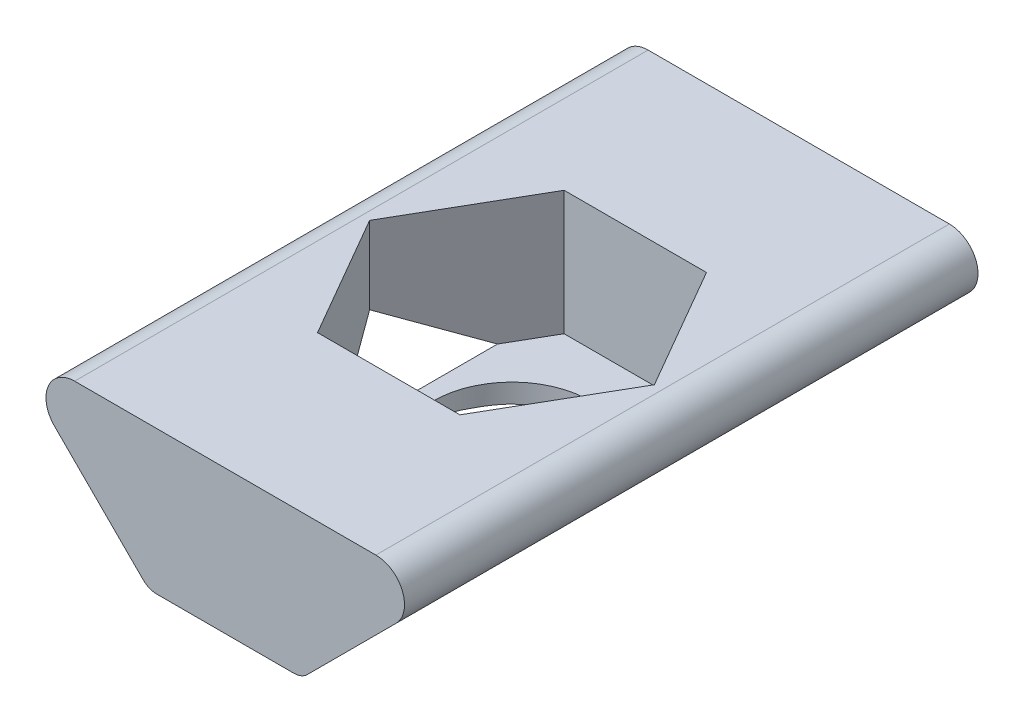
from build123d import *

# Parameters (mm, degrees)
SALIENTE_EXTRUIR1_DEPTH = 15
REDONDEO1_R             = 1.5
REDONDEO2_R             = 1
CORTAR_EXTRUIR1_DEPTH   = 6.5
CROQUIS3_R              = 4.1
CORTAR_EXTRUIR2_DEPTH   = 19.847005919


with BuildPart() as part:
    # Croquis1 → Saliente-Extruir1 (new, symmetric)
    with BuildSketch(Plane.XY):
        Polygon((11.5, 3.75), (-11.5, 3.75), (-4, -3.75), (4, -3.75), align=None)
    extrude(amount=SALIENTE_EXTRUIR1_DEPTH, both=True)

    # Redondeo1
    redondeo1_edges = [part.edges().sort_by_distance(p)[0] for p in [
        (-11.5, 3.75, 0),
        (11.5, 3.75, 0),
    ]]
    fillet(redondeo1_edges, radius=REDONDEO1_R)

    # Redondeo2
    redondeo2_edges = [part.edges().sort_by_distance(p)[0] for p in [
        (4, -3.75, 0),
        (-4, -3.75, 0),
    ]]
    fillet(redondeo2_edges, radius=REDONDEO2_R)

    # Croquis2 → Cortar-Extruir1 (cut)
    with BuildSketch(Plane(origin=(0, 3.75, 0), x_dir=(1, 0, 0), z_dir=(0, 1, 0))):
        Polygon((7.447818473, 0), (3.723909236, 6.45), (-3.723909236, 6.45), (-7.447818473, 0), (-3.723909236, -6.45), (3.723909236, -6.45), align=None)
    extrude(amount=-CORTAR_EXTRUIR1_DEPTH, mode=Mode.SUBTRACT)

    # Croquis3 → Cortar-Extruir2 (cut, through all)
    with BuildSketch(Plane(origin=(0, -2.75, 0), x_dir=(1, 0, 0), z_dir=(0, 1, 0))):
        with Locations(Location((0, 0, 0), (0, 0, 270))):
            Circle(CROQUIS3_R)
    extrude(amount=-CORTAR_EXTRUIR2_DEPTH, mode=Mode.SUBTRACT)


solid = part.part
